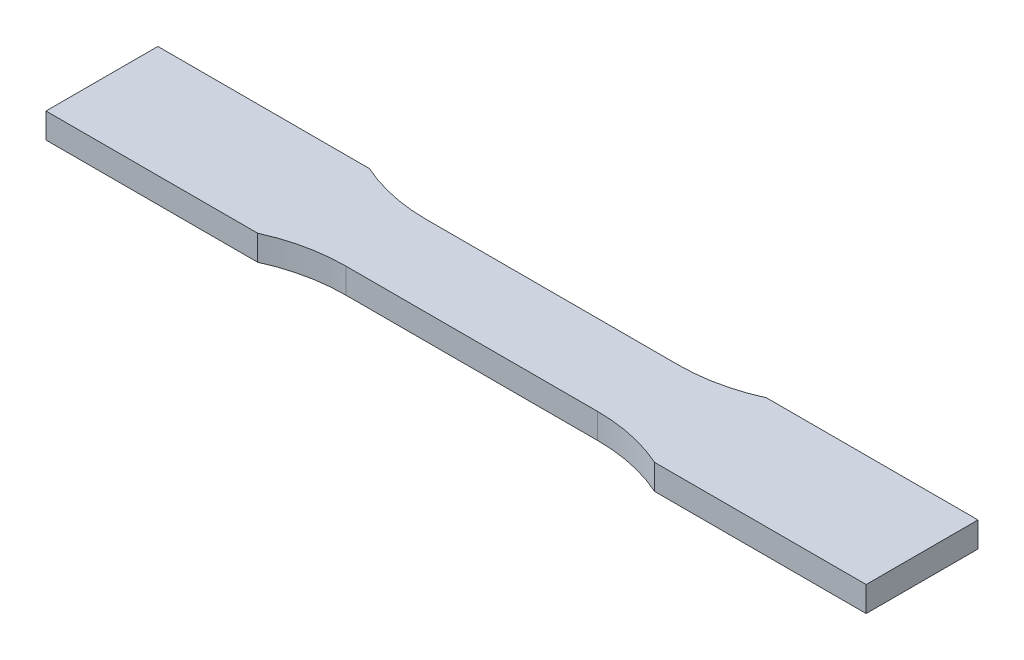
from build123d import *

# Parameters (mm, degrees)
ZUGPROBE_DEPTH      = 2.5
ZUGPROBE_DEPTH_BACK = 2.5


with BuildPart() as part:
    # Skizze1 → Zugprobe (new, two sides: drawn at the far end of the back side and taken through both)
    with BuildSketch(Plane(origin=(0, 0, 0), x_dir=(1, 0, 0), z_dir=(0, 1, 0)).offset(-ZUGPROBE_DEPTH_BACK)):
        with BuildLine():
            Line((-25, 8), (25, 8))
            ThreePointArc((25, 8), (32.365459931, 8.783775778), (39.401041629, 11.1))
            Line((39.401041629, 11.1), (81.401041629, 11.1))
            Line((81.401041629, 11.1), (81.401041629, -11.1))
            Line((81.401041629, -11.1), (39.401041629, -11.1))
            ThreePointArc((39.401041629, -11.1), (32.365459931, -8.783775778), (25, -8))
            Line((25, -8), (-25, -8))
            ThreePointArc((-25, -8), (-32.365459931, -8.783775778), (-39.401041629, -11.1))
            Line((-39.401041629, -11.1), (-81.401041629, -11.1))
            Line((-81.401041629, -11.1), (-81.401041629, 11.1))
            Line((-81.401041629, 11.1), (-39.401041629, 11.1))
            ThreePointArc((-39.401041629, 11.1), (-32.365459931, 8.783775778), (-25, 8))
        make_face()
    extrude(amount=ZUGPROBE_DEPTH + ZUGPROBE_DEPTH_BACK)


solid = part.part
